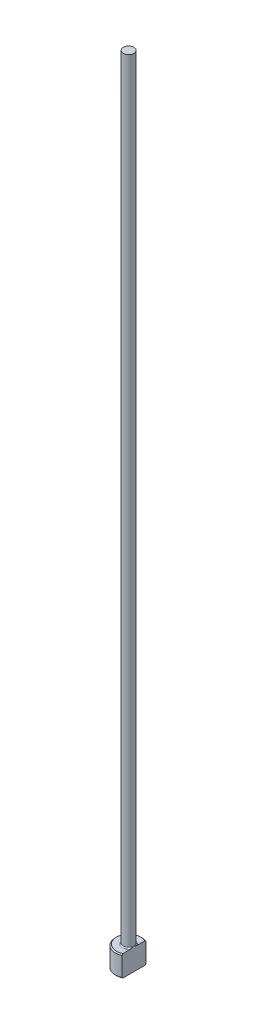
from build123d import *
from build123d.topology import SkipClean

# Parameters (mm, degrees)
CHAMFER1_SIZE    = 0.2
FILLET1_R        = 0.2
KEYED_HEAD_DEPTH = 151.041660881


with BuildPart() as part:
    # Sketch1 → Revolve1 (revolve)
    with BuildSketch(Plane.XY, mode=Mode.PRIVATE) as revolve1_sk:
        Polygon((0, 0), (-2.5, 0), (-2.5, 4), (-1, 4), (-1, 150), (0, 150), align=None)
    revolve(revolve1_sk.sketch.rotate(Axis((0, 259.958771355, 0), (0, -1, 0)), 270), axis=Axis((0, 259.958771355, 0), (0, -1, 0)))

    # Chamfer1
    chamfer1_edges = [part.edges().sort_by_distance(p)[0] for p in [
        (0, 4, -2.5),
        (0, 0, -2.5),
    ]]
    chamfer(chamfer1_edges, length=CHAMFER1_SIZE)

    # Fillet1
    fillet1_edges = [part.edges().sort_by_distance(p)[0] for p in [
        (0, 4, -1),
    ]]
    fillet(fillet1_edges, radius=FILLET1_R)

    # Sketch2 → KEYED HEAD (cut, through all)
    with SkipClean():  # the faces are left unmerged after this step: merging them gives an invalid solid
        with BuildSketch(Plane(origin=(0, 0, 0), x_dir=(1, 0, 0), z_dir=(0, 1, 0))):
            with BuildLine():
                Line((1, -2.291287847), (1, 2.291287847))
                ThreePointArc((1, 2.291287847), (2.5, 0), (1, -2.291287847))
            make_face()
        extrude(amount=KEYED_HEAD_DEPTH, mode=Mode.SUBTRACT)


solid = part.part
